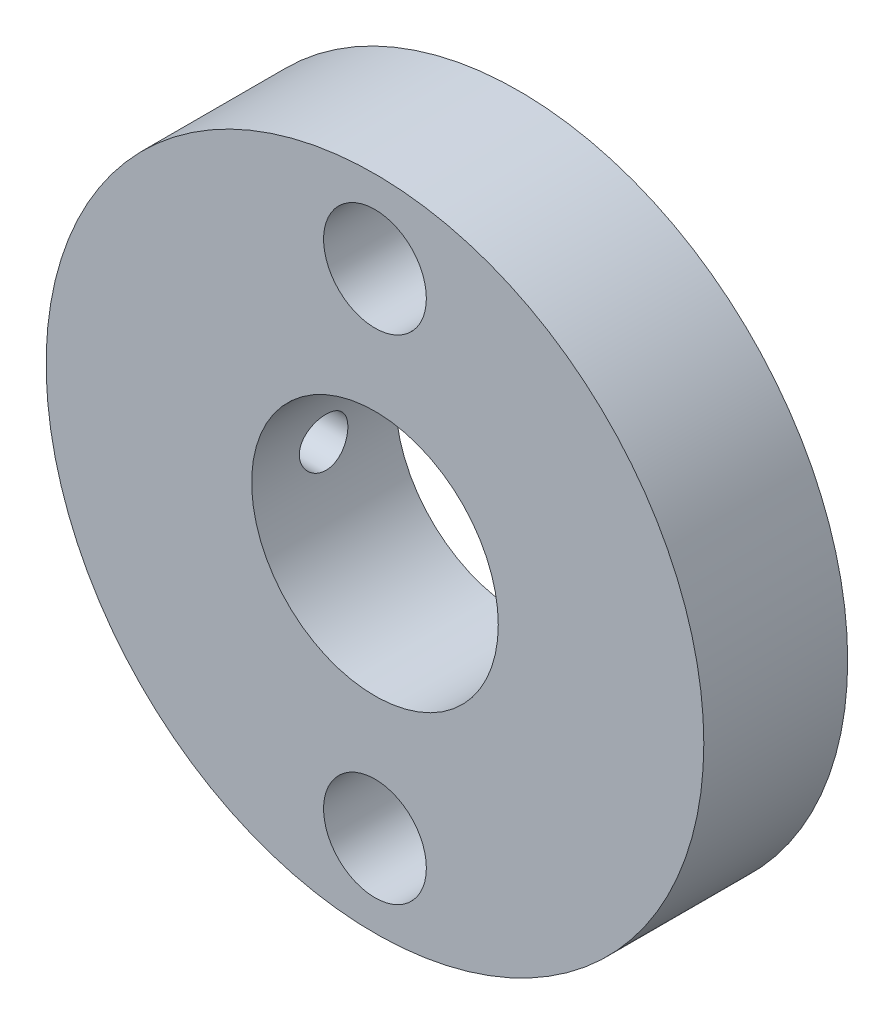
from build123d import *

# Parameters (mm, degrees)
SKETCH2_R                = 50.8
BOSS_EXTRUDE1_DEPTH      = 22.225
SKETCH5_R                = 4.925
CUT_EXTRUDE2_DEPTH       = 125.578127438
SKETCH13_R               = 7.9375
CUT_EXTRUDE8_DEPTH       = 15.875
SKETCH17_R               = 19.05
CUT_EXTRUDE10_DEPTH      = 48.006
CUT_EXTRUDE11_DEPTH      = 14.986
CUT_EXTRUDE11_DEPTH_BACK = 55.626
SKETCH19_R               = 3.75


with BuildPart() as part:
    # Sketch2 → Boss-Extrude1 (new body)
    with BuildSketch(Plane.XY):
        with Locations((19.05, 49.931011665)):
            Circle(SKETCH2_R)
    extrude(amount=BOSS_EXTRUDE1_DEPTH)

    # Sketch5 → Cut-Extrude2 (cut, through all)
    with BuildSketch(Plane.XY.offset(22.225)):
        with Locations((19.05, 88.031011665)):
            Circle(SKETCH5_R)
        with Locations((19.05, 11.831011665)):
            Circle(SKETCH5_R)
    extrude(amount=-CUT_EXTRUDE2_DEPTH, mode=Mode.SUBTRACT)

    # Sketch13 → Cut-Extrude8 (cut)
    with BuildSketch(Plane.XY.offset(22.225)):
        with Locations((19.05, 88.031011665)):
            Circle(SKETCH13_R)
        with Locations((19.05, 11.831011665)):
            Circle(SKETCH13_R)
    extrude(amount=-CUT_EXTRUDE8_DEPTH, mode=Mode.SUBTRACT)

    # Sketch17 → Cut-Extrude10 (cut)
    with BuildSketch(Plane.XY.offset(22.225)):
        with Locations((19.05, 49.931011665)):
            Circle(SKETCH17_R)
    extrude(amount=-CUT_EXTRUDE10_DEPTH, mode=Mode.SUBTRACT)

    # Sketch19 → Cut-Extrude11 (cut, two sides: drawn at the far end of the back side and taken through both)
    with BuildSketch(Plane(origin=(0, 0, 0), x_dir=(0, 0, -1), z_dir=(1, 0, 0)).offset(-CUT_EXTRUDE11_DEPTH_BACK)):
        with Locations(Location((-11.1125, 49.931011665, 0), (0, 0, 180))):
            Circle(SKETCH19_R)
    extrude(amount=CUT_EXTRUDE11_DEPTH + CUT_EXTRUDE11_DEPTH_BACK, mode=Mode.SUBTRACT)


solid = part.part
